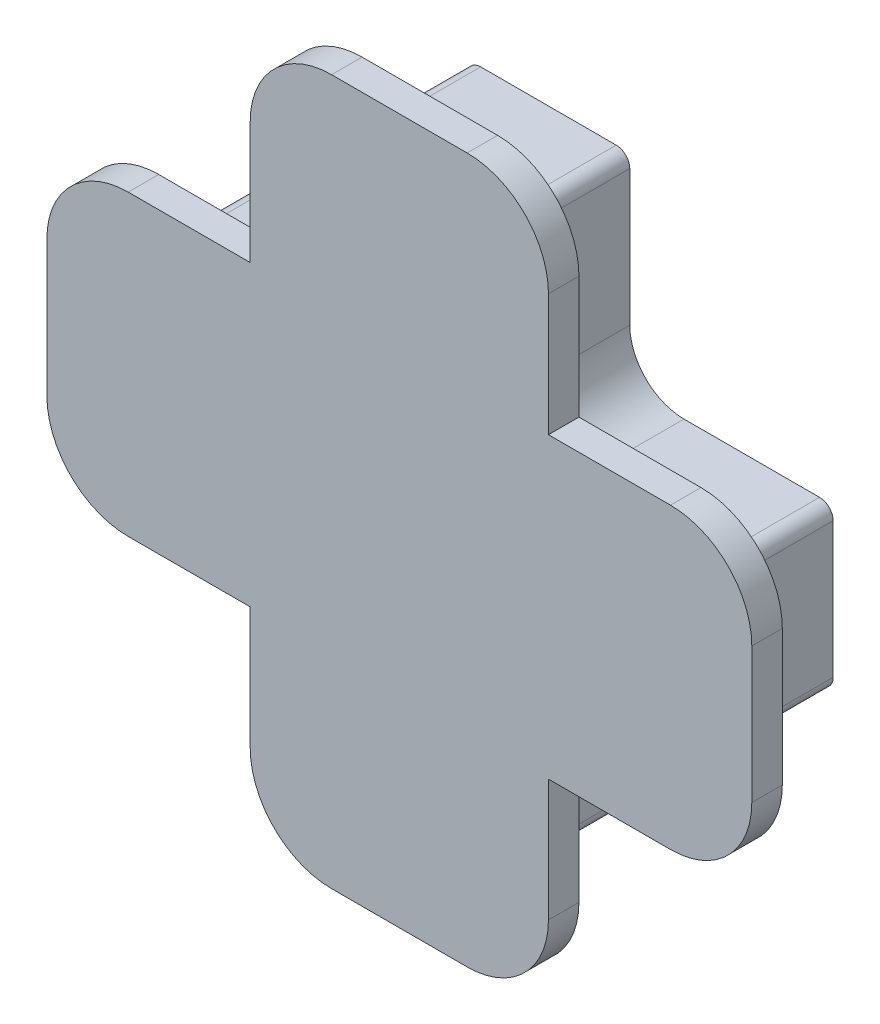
from build123d import *

# Parameters (mm, degrees)
BOSS_EXTRUDE1_DEPTH = 1.905
BOSS_EXTRUDE2_DEPTH = 4.445
SKETCH5_W           = 0.762
SKETCH5_H           = 26.416
CUT_EXTRUDE3_DEPTH  = 62.870143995


with BuildPart() as part:
    # Sketch1 → Boss-Extrude1 (new body)
    with BuildSketch(Plane.XY):
        with BuildLine():
            Line((29.225, -20.447), (24.145, -20.447))
            ThreePointArc((24.145, -20.447), (21.989738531, -21.339738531), (21.097, -23.495))
            Line((21.097, -23.495), (21.097, -28.067))
            Line((21.097, -28.067), (16.525, -28.067))
            ThreePointArc((16.525, -28.067), (14.369738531, -28.959738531), (13.477, -31.115))
            Line((13.477, -31.115), (13.477, -36.195))
            ThreePointArc((13.477, -36.195), (14.369738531, -38.350261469), (16.525, -39.243))
            Line((16.525, -39.243), (21.097, -39.243))
            Line((21.097, -39.243), (21.097, -43.815))
            ThreePointArc((21.097, -43.815), (21.989738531, -45.970261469), (24.145, -46.863))
            Line((24.145, -46.863), (29.225, -46.863))
            ThreePointArc((29.225, -46.863), (31.380261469, -45.970261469), (32.273, -43.815))
            Line((32.273, -43.815), (32.273, -39.243))
            Line((32.273, -39.243), (36.845, -39.243))
            ThreePointArc((36.845, -39.243), (39.000261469, -38.350261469), (39.893, -36.195))
            Line((39.893, -36.195), (39.893, -31.115))
            ThreePointArc((39.893, -31.115), (39.000261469, -28.959738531), (36.845, -28.067))
            Line((36.845, -28.067), (32.273, -28.067))
            Line((32.273, -28.067), (32.273, -23.495))
            ThreePointArc((32.273, -23.495), (31.380261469, -21.339738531), (29.225, -20.447))
        make_face()
    extrude(amount=-BOSS_EXTRUDE1_DEPTH)

    # Sketch2 → Boss-Extrude2 (add)
    with BuildSketch(Plane(origin=(0, 0, -1.905), x_dir=(-1, 0, 0), z_dir=(0, 0, -1))):
        with BuildLine():
            Line((-23.637, -28.575), (-23.637, -23.495))
            ThreePointArc((-23.637, -23.495), (-23.785789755, -23.135789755), (-24.145, -22.987))
            Line((-24.145, -22.987), (-29.225, -22.987))
            ThreePointArc((-29.225, -22.987), (-29.584210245, -23.135789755), (-29.733, -23.495))
            Line((-29.733, -23.495), (-29.733, -28.575))
            ThreePointArc((-29.733, -28.575), (-30.328159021, -30.011840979), (-31.765, -30.607))
            Line((-31.765, -30.607), (-36.845, -30.607))
            ThreePointArc((-36.845, -30.607), (-37.204210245, -30.755789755), (-37.353, -31.115))
            Line((-37.353, -31.115), (-37.353, -36.195))
            ThreePointArc((-37.353, -36.195), (-37.204210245, -36.554210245), (-36.845, -36.703))
            Line((-36.845, -36.703), (-31.765, -36.703))
            ThreePointArc((-31.765, -36.703), (-30.328159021, -37.298159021), (-29.733, -38.735))
            Line((-29.733, -38.735), (-29.733, -43.815))
            ThreePointArc((-29.733, -43.815), (-29.584210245, -44.174210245), (-29.225, -44.323))
            Line((-29.225, -44.323), (-24.145, -44.323))
            ThreePointArc((-24.145, -44.323), (-23.785789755, -44.174210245), (-23.637, -43.815))
            Line((-23.637, -43.815), (-23.637, -38.735))
            ThreePointArc((-23.637, -38.735), (-23.041840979, -37.298159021), (-21.605, -36.703))
            Line((-21.605, -36.703), (-16.525, -36.703))
            ThreePointArc((-16.525, -36.703), (-16.165789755, -36.554210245), (-16.017, -36.195))
            Line((-16.017, -36.195), (-16.017, -31.115))
            ThreePointArc((-16.017, -31.115), (-16.165789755, -30.755789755), (-16.525, -30.607))
            Line((-16.525, -30.607), (-21.605, -30.607))
            ThreePointArc((-21.605, -30.607), (-23.041840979, -30.011840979), (-23.637, -28.575))
        make_face()
    extrude(amount=BOSS_EXTRUDE2_DEPTH)

    # Sketch5 → Cut-Extrude3 (cut, through all)
    with BuildSketch(Plane(origin=(0, 0, 0), x_dir=(0, 0, -1), z_dir=(1, 0, 0))):
        with Locations((0.381, -33.655)):
            Rectangle(SKETCH5_W, SKETCH5_H)
    extrude(amount=CUT_EXTRUDE3_DEPTH, mode=Mode.SUBTRACT)


solid = part.part
